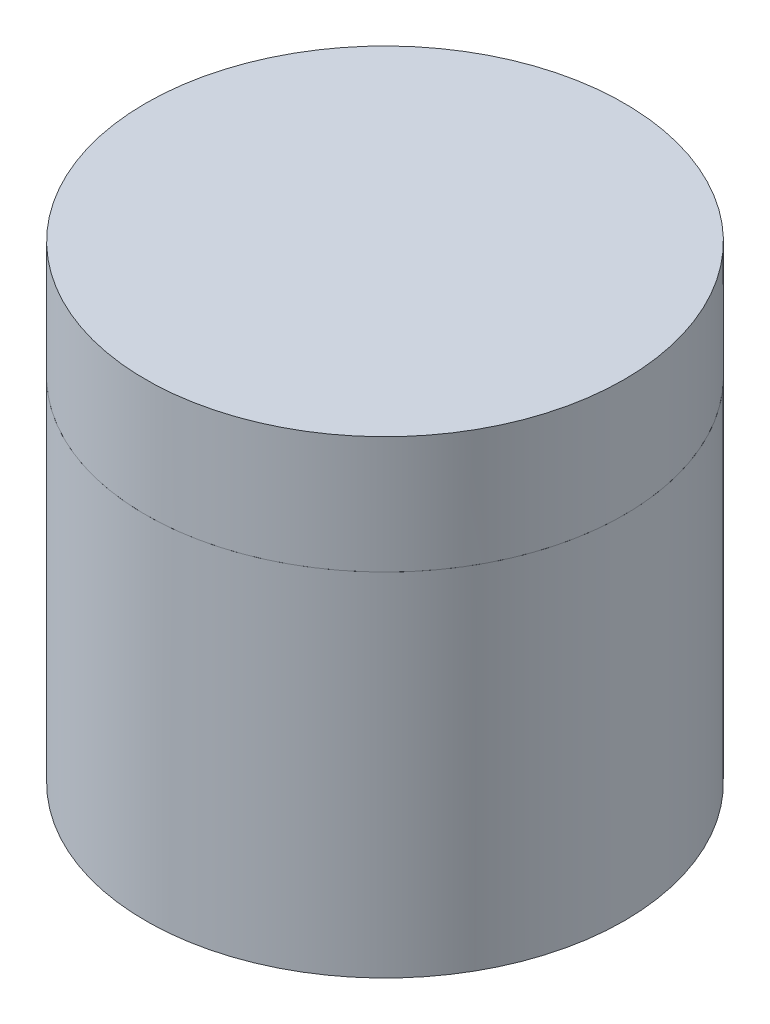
ISO-10303-21;
HEADER;
FILE_DESCRIPTION(('STEP AP214'),'2;1');
FILE_NAME('part.step','',(''),(''),'','','');
FILE_SCHEMA(('AUTOMOTIVE_DESIGN { 1 0 10303 214 1 1 1 1 }'));
ENDSEC;
DATA;
#1=APPLICATION_CONTEXT('core data for automotive mechanical design processes');
#2=APPLICATION_PROTOCOL_DEFINITION('international standard','automotive_design',2000,#1);
#3=PRODUCT_CONTEXT('',#1,'mechanical');
#4=PRODUCT('Part','Part','',(#3));
#5=PRODUCT_RELATED_PRODUCT_CATEGORY('part','',(#4));
#6=PRODUCT_DEFINITION_FORMATION('','',#4);
#7=PRODUCT_DEFINITION_CONTEXT('part definition',#1,'design');
#8=PRODUCT_DEFINITION('design','',#6,#7);
#9=PRODUCT_DEFINITION_SHAPE('','',#8);
#10=(LENGTH_UNIT() NAMED_UNIT(*) SI_UNIT(.MILLI.,.METRE.));
#11=(NAMED_UNIT(*) PLANE_ANGLE_UNIT() SI_UNIT($,.RADIAN.));
#12=(NAMED_UNIT(*) SI_UNIT($,.STERADIAN.) SOLID_ANGLE_UNIT());
#13=UNCERTAINTY_MEASURE_WITH_UNIT(LENGTH_MEASURE(1.E-05),#10,'distance_accuracy_value','');
#14=(GEOMETRIC_REPRESENTATION_CONTEXT(3) GLOBAL_UNCERTAINTY_ASSIGNED_CONTEXT((#13)) GLOBAL_UNIT_ASSIGNED_CONTEXT((#10,
#11,#12)) REPRESENTATION_CONTEXT('',''));
#15=CARTESIAN_POINT('',(0.,0.,0.));
#16=DIRECTION('',(0.,0.,1.));
#17=DIRECTION('',(1.,0.,0.));
#18=AXIS2_PLACEMENT_3D('',#15,#16,#17);
#19=CARTESIAN_POINT('',(0.,11.530484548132,0.));
#20=DIRECTION('',(0.,-1.,0.));
#21=DIRECTION('',(0.,0.,-1.));
#22=AXIS2_PLACEMENT_3D('',#19,#20,#21);
#23=CYLINDRICAL_SURFACE('',#22,31.115);
#24=CARTESIAN_POINT('',(0.,-3.70951545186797,0.));
#25=DIRECTION('',(0.,1.,0.));
#26=DIRECTION('',(-1.,0.,0.));
#27=AXIS2_PLACEMENT_3D('',#24,#25,#26);
#28=CIRCLE('',#27,31.115);
#29=CARTESIAN_POINT('',(-31.115,-3.70951545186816,0.));
#30=VERTEX_POINT('',#29);
#31=EDGE_CURVE('E91',#30,#30,#28,.F.);
#32=ORIENTED_EDGE('',*,*,#31,.F.);
#33=EDGE_LOOP('',(#32));
#34=FACE_BOUND('',#33,.T.);
#35=CARTESIAN_POINT('',(0.,11.530484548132,0.));
#36=DIRECTION('',(0.,-1.,0.));
#37=DIRECTION('',(1.,0.,0.));
#38=AXIS2_PLACEMENT_3D('',#35,#36,#37);
#39=CIRCLE('',#38,31.115);
#40=CARTESIAN_POINT('',(31.115,11.5304845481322,0.));
#41=VERTEX_POINT('',#40);
#42=EDGE_CURVE('E126',#41,#41,#39,.T.);
#43=ORIENTED_EDGE('',*,*,#42,.T.);
#44=EDGE_LOOP('',(#43));
#45=FACE_BOUND('',#44,.T.);
#46=ADVANCED_FACE('F88',(#34,#45),#23,.T.);
#47=CARTESIAN_POINT('',(0.,11.530484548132,0.));
#48=DIRECTION('',(0.,-1.,0.));
#49=DIRECTION('',(1.,0.,0.));
#50=AXIS2_PLACEMENT_3D('',#47,#48,#49);
#51=PLANE('',#50);
#52=ORIENTED_EDGE('',*,*,#42,.F.);
#53=EDGE_LOOP('',(#52));
#54=FACE_BOUND('',#53,.T.);
#55=ADVANCED_FACE('F107',(#54),#51,.F.);
#56=CARTESIAN_POINT('',(0.,-12.7,0.));
#57=DIRECTION('',(0.,1.,0.));
#58=DIRECTION('',(1.,0.,0.));
#59=AXIS2_PLACEMENT_3D('',#56,#57,#58);
#60=SPHERICAL_SURFACE('',#59,20.32);
#61=CARTESIAN_POINT('',(0.,1.1128041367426,0.));
#62=DIRECTION('',(0.,1.,0.));
#63=DIRECTION('',(0.,0.,1.));
#64=AXIS2_PLACEMENT_3D('',#61,#62,#63);
#65=CIRCLE('',#64,14.9033164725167);
#66=CARTESIAN_POINT('',(0.,1.1128041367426,14.9033164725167));
#67=VERTEX_POINT('',#66);
#68=EDGE_CURVE('E127',#67,#67,#65,.T.);
#69=ORIENTED_EDGE('',*,*,#68,.F.);
#70=EDGE_LOOP('',(#69));
#71=FACE_BOUND('',#70,.T.);
#72=ADVANCED_FACE('F116',(#71),#60,.F.);
#73=CARTESIAN_POINT('',(0.,2.6162,0.));
#74=DIRECTION('',(0.,1.,0.));
#75=DIRECTION('',(0.,0.,1.));
#76=AXIS2_PLACEMENT_3D('',#73,#74,#75);
#77=TOROIDAL_SURFACE('',#76,17.6998189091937,3.175);
#78=ORIENTED_EDGE('',*,*,#68,.T.);
#79=EDGE_LOOP('',(#78));
#80=FACE_BOUND('',#79,.T.);
#81=CARTESIAN_POINT('',(0.,-0.546657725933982,0.));
#82=DIRECTION('',(0.,1.,0.));
#83=DIRECTION('',(0.,0.,1.));
#84=AXIS2_PLACEMENT_3D('',#81,#82,#83);
#85=CIRCLE('',#84,17.4224094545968);
#86=CARTESIAN_POINT('',(0.,-0.546657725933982,17.4224094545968));
#87=VERTEX_POINT('',#86);
#88=EDGE_CURVE('E96',#87,#87,#85,.T.);
#89=ORIENTED_EDGE('',*,*,#88,.F.);
#90=EDGE_LOOP('',(#89));
#91=FACE_BOUND('',#90,.T.);
#92=ADVANCED_FACE('F111',(#80,#91),#77,.T.);
#93=CARTESIAN_POINT('',(0.,-3.70951545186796,0.));
#94=DIRECTION('',(0.,1.,0.));
#95=DIRECTION('',(0.,0.,1.));
#96=AXIS2_PLACEMENT_3D('',#93,#94,#95);
#97=TOROIDAL_SURFACE('',#96,17.145,3.175);
#98=CARTESIAN_POINT('',(0.,-3.70951545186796,0.));
#99=DIRECTION('',(0.,1.,0.));
#100=DIRECTION('',(0.,0.,1.));
#101=AXIS2_PLACEMENT_3D('',#98,#99,#100);
#102=CIRCLE('',#101,20.32);
#103=CARTESIAN_POINT('',(0.,-3.70951545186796,-20.32));
#104=VERTEX_POINT('',#103);
#105=EDGE_CURVE('E13',#104,#104,#102,.F.);
#106=ORIENTED_EDGE('',*,*,#105,.T.);
#107=EDGE_LOOP('',(#106));
#108=FACE_BOUND('',#107,.T.);
#109=ORIENTED_EDGE('',*,*,#88,.T.);
#110=EDGE_LOOP('',(#109));
#111=FACE_BOUND('',#110,.T.);
#112=ADVANCED_FACE('F100',(#108,#111),#97,.F.);
#113=CARTESIAN_POINT('',(-0.132956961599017,-3.70951545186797,-20.3200002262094));
#114=DIRECTION('',(0.,1.,0.));
#115=DIRECTION('',(0.999999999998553,0.,1.70137349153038E-06));
#116=AXIS2_PLACEMENT_3D('',#113,#114,#115);
#117=PLANE('',#116);
#118=ORIENTED_EDGE('',*,*,#31,.T.);
#119=EDGE_LOOP('',(#118));
#120=FACE_BOUND('',#119,.T.);
#121=ORIENTED_EDGE('',*,*,#105,.F.);
#122=EDGE_LOOP('',(#121));
#123=FACE_BOUND('',#122,.T.);
#124=ADVANCED_FACE('F103',(#120,#123),#117,.F.);
#125=CLOSED_SHELL('',(#46,#55,#72,#92,#112,#124));
#126=MANIFOLD_SOLID_BREP('B2_NOT_SHOWN',#125);
#127=CARTESIAN_POINT('',(0.,-49.429515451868,0.));
#128=DIRECTION('',(0.,-1.,0.));
#129=DIRECTION('',(1.,0.,0.));
#130=AXIS2_PLACEMENT_3D('',#127,#128,#129);
#131=PLANE('',#130);
#132=CARTESIAN_POINT('',(0.,-49.429515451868,0.));
#133=DIRECTION('',(0.,-1.,0.));
#134=DIRECTION('',(1.,0.,0.));
#135=AXIS2_PLACEMENT_3D('',#132,#133,#134);
#136=CIRCLE('',#135,31.115);
#137=CARTESIAN_POINT('',(31.115,-49.4295154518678,0.));
#138=VERTEX_POINT('',#137);
#139=EDGE_CURVE('E252',#138,#138,#136,.T.);
#140=ORIENTED_EDGE('',*,*,#139,.T.);
#141=EDGE_LOOP('',(#140));
#142=FACE_BOUND('',#141,.T.);
#143=ADVANCED_FACE('F227',(#142),#131,.T.);
#144=CARTESIAN_POINT('',(0.,11.530484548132,0.));
#145=DIRECTION('',(0.,-1.,0.));
#146=DIRECTION('',(0.,0.,-1.));
#147=AXIS2_PLACEMENT_3D('',#144,#145,#146);
#148=CYLINDRICAL_SURFACE('',#147,31.115);
#149=ORIENTED_EDGE('',*,*,#139,.F.);
#150=EDGE_LOOP('',(#149));
#151=FACE_BOUND('',#150,.T.);
#152=CARTESIAN_POINT('',(0.,-3.70951545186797,0.));
#153=DIRECTION('',(0.,1.,0.));
#154=DIRECTION('',(-1.,0.,0.));
#155=AXIS2_PLACEMENT_3D('',#152,#153,#154);
#156=CIRCLE('',#155,31.115);
#157=CARTESIAN_POINT('',(-31.115,-3.70951545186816,0.));
#158=VERTEX_POINT('',#157);
#159=EDGE_CURVE('E86',#158,#158,#156,.F.);
#160=ORIENTED_EDGE('',*,*,#159,.T.);
#161=EDGE_LOOP('',(#160));
#162=FACE_BOUND('',#161,.T.);
#163=ADVANCED_FACE('F229',(#151,#162),#148,.T.);
#164=CARTESIAN_POINT('',(0.,-7.62,0.));
#165=DIRECTION('',(0.,1.,0.));
#166=DIRECTION('',(0.,0.,1.));
#167=AXIS2_PLACEMENT_3D('',#164,#165,#166);
#168=PLANE('',#167);
#169=CARTESIAN_POINT('',(0.,-7.62,0.));
#170=DIRECTION('',(0.,1.,0.));
#171=DIRECTION('',(0.,0.,1.));
#172=AXIS2_PLACEMENT_3D('',#169,#170,#171);
#173=CIRCLE('',#172,3.16856898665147);
#174=CARTESIAN_POINT('',(0.,-7.62,3.16856898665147));
#175=VERTEX_POINT('',#174);
#176=EDGE_CURVE('E250',#175,#175,#173,.T.);
#177=ORIENTED_EDGE('',*,*,#176,.T.);
#178=EDGE_LOOP('',(#177));
#179=FACE_BOUND('',#178,.T.);
#180=ADVANCED_FACE('F285',(#179),#168,.T.);
#181=CARTESIAN_POINT('',(0.,-7.62,0.));
#182=DIRECTION('',(0.,1.,0.));
#183=DIRECTION('',(0.,0.,1.));
#184=AXIS2_PLACEMENT_3D('',#181,#182,#183);
#185=CONICAL_SURFACE('',#184,3.16856898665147,0.174532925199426);
#186=CARTESIAN_POINT('',(0.,-1.19456186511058,0.));
#187=DIRECTION('',(0.,1.,0.));
#188=DIRECTION('',(0.,0.,1.));
#189=AXIS2_PLACEMENT_3D('',#186,#187,#188);
#190=CIRCLE('',#189,4.30154709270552);
#191=CARTESIAN_POINT('',(0.,-1.19456186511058,4.30154709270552));
#192=VERTEX_POINT('',#191);
#193=EDGE_CURVE('E254',#192,#192,#190,.F.);
#194=ORIENTED_EDGE('',*,*,#193,.F.);
#195=EDGE_LOOP('',(#194));
#196=FACE_BOUND('',#195,.T.);
#197=ORIENTED_EDGE('',*,*,#176,.F.);
#198=EDGE_LOOP('',(#197));
#199=FACE_BOUND('',#198,.T.);
#200=ADVANCED_FACE('F290',(#196,#199),#185,.F.);
#201=CARTESIAN_POINT('',(0.,-1.3323951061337,0.));
#202=DIRECTION('',(0.,1.,0.));
#203=DIRECTION('',(0.,0.,1.));
#204=AXIS2_PLACEMENT_3D('',#201,#202,#203);
#205=TOROIDAL_SURFACE('',#204,5.08323824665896,0.79375);
#206=ORIENTED_EDGE('',*,*,#193,.T.);
#207=EDGE_LOOP('',(#206));
#208=FACE_BOUND('',#207,.T.);
#209=CARTESIAN_POINT('',(0.,-0.560541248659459,0.));
#210=DIRECTION('',(0.,-1.,0.));
#211=DIRECTION('',(0.,0.,-1.));
#212=AXIS2_PLACEMENT_3D('',#209,#210,#211);
#213=CIRCLE('',#212,5.26838868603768);
#214=CARTESIAN_POINT('',(0.,-0.560541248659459,-5.26838868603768));
#215=VERTEX_POINT('',#214);
#216=EDGE_CURVE('E247',#215,#215,#213,.F.);
#217=ORIENTED_EDGE('',*,*,#216,.T.);
#218=EDGE_LOOP('',(#217));
#219=FACE_BOUND('',#218,.T.);
#220=ADVANCED_FACE('F265',(#208,#219),#205,.T.);
#221=CARTESIAN_POINT('',(0.,-20.32,0.));
#222=DIRECTION('',(0.,1.,0.));
#223=DIRECTION('',(0.,0.,1.));
#224=AXIS2_PLACEMENT_3D('',#221,#222,#223);
#225=DEGENERATE_TOROIDAL_SURFACE('',#224,0.528537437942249,20.32,.T.);
#226=ORIENTED_EDGE('',*,*,#216,.F.);
#227=EDGE_LOOP('',(#226));
#228=FACE_BOUND('',#227,.T.);
#229=CARTESIAN_POINT('',(0.,-5.95417552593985,0.));
#230=DIRECTION('',(0.,1.,0.));
#231=DIRECTION('',(0.,0.,1.));
#232=AXIS2_PLACEMENT_3D('',#229,#230,#231);
#233=CIRCLE('',#232,14.8995320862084);
#234=CARTESIAN_POINT('',(0.,-5.95417552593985,14.8995320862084));
#235=VERTEX_POINT('',#234);
#236=EDGE_CURVE('E241',#235,#235,#233,.T.);
#237=ORIENTED_EDGE('',*,*,#236,.T.);
#238=EDGE_LOOP('',(#237));
#239=FACE_BOUND('',#238,.T.);
#240=ADVANCED_FACE('F267',(#228,#239),#225,.T.);
#241=CARTESIAN_POINT('',(0.,-3.70951545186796,0.));
#242=DIRECTION('',(0.,1.,0.));
#243=DIRECTION('',(0.,0.,1.));
#244=AXIS2_PLACEMENT_3D('',#241,#242,#243);
#245=TOROIDAL_SURFACE('',#244,17.145,3.175);
#246=ORIENTED_EDGE('',*,*,#236,.F.);
#247=EDGE_LOOP('',(#246));
#248=FACE_BOUND('',#247,.T.);
#249=CARTESIAN_POINT('',(0.,-3.70951545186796,0.));
#250=DIRECTION('',(0.,1.,0.));
#251=DIRECTION('',(0.,0.,1.));
#252=AXIS2_PLACEMENT_3D('',#249,#250,#251);
#253=CIRCLE('',#252,20.32);
#254=CARTESIAN_POINT('',(0.,-3.70951545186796,-20.32));
#255=VERTEX_POINT('',#254);
#256=EDGE_CURVE('E234',#255,#255,#253,.F.);
#257=ORIENTED_EDGE('',*,*,#256,.F.);
#258=EDGE_LOOP('',(#257));
#259=FACE_BOUND('',#258,.T.);
#260=ADVANCED_FACE('F238',(#248,#259),#245,.F.);
#261=CARTESIAN_POINT('',(-0.132956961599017,-3.70951545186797,-20.3200002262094));
#262=DIRECTION('',(0.,1.,0.));
#263=DIRECTION('',(0.999999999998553,0.,1.70137349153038E-06));
#264=AXIS2_PLACEMENT_3D('',#261,#262,#263);
#265=PLANE('',#264);
#266=ORIENTED_EDGE('',*,*,#159,.F.);
#267=EDGE_LOOP('',(#266));
#268=FACE_BOUND('',#267,.T.);
#269=ORIENTED_EDGE('',*,*,#256,.T.);
#270=EDGE_LOOP('',(#269));
#271=FACE_BOUND('',#270,.T.);
#272=ADVANCED_FACE('F274',(#268,#271),#265,.T.);
#273=CLOSED_SHELL('',(#143,#163,#180,#200,#220,#240,#260,#272));
#274=MANIFOLD_SOLID_BREP('B7',#273);
#275=CARTESIAN_POINT('',(0.,-3.70951545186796,0.));
#276=DIRECTION('',(0.,1.,0.));
#277=DIRECTION('',(0.,0.,1.));
#278=AXIS2_PLACEMENT_3D('',#275,#276,#277);
#279=TOROIDAL_SURFACE('',#278,17.145,3.175);
#280=CARTESIAN_POINT('',(0.,-5.95417552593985,0.));
#281=DIRECTION('',(0.,1.,0.));
#282=DIRECTION('',(0.,0.,1.));
#283=AXIS2_PLACEMENT_3D('',#280,#281,#282);
#284=CIRCLE('',#283,14.8995320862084);
#285=CARTESIAN_POINT('',(0.,-5.95417552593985,14.8995320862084));
#286=VERTEX_POINT('',#285);
#287=EDGE_CURVE('E674',#286,#286,#284,.T.);
#288=ORIENTED_EDGE('',*,*,#287,.T.);
#289=EDGE_LOOP('',(#288));
#290=FACE_BOUND('',#289,.T.);
#291=CARTESIAN_POINT('',(0.,-3.70951545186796,0.));
#292=DIRECTION('',(0.,-1.,0.));
#293=DIRECTION('',(0.,0.,-1.));
#294=AXIS2_PLACEMENT_3D('',#291,#292,#293);
#295=CIRCLE('',#294,20.32);
#296=CARTESIAN_POINT('',(0.,-3.70951545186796,-20.32));
#297=VERTEX_POINT('',#296);
#298=EDGE_CURVE('E534',#297,#297,#295,.T.);
#299=ORIENTED_EDGE('',*,*,#298,.T.);
#300=EDGE_LOOP('',(#299));
#301=FACE_BOUND('',#300,.T.);
#302=ADVANCED_FACE('F645',(#290,#301),#279,.T.);
#303=ORIENTED_EDGE('',*,*,#298,.F.);
#304=EDGE_LOOP('',(#303));
#305=FACE_BOUND('',#304,.T.);
#306=CARTESIAN_POINT('',(0.,-0.546657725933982,0.));
#307=DIRECTION('',(0.,1.,0.));
#308=DIRECTION('',(0.,0.,1.));
#309=AXIS2_PLACEMENT_3D('',#306,#307,#308);
#310=CIRCLE('',#309,17.4224094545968);
#311=CARTESIAN_POINT('',(0.,-0.546657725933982,17.4224094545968));
#312=VERTEX_POINT('',#311);
#313=EDGE_CURVE('E663',#312,#312,#310,.T.);
#314=ORIENTED_EDGE('',*,*,#313,.F.);
#315=EDGE_LOOP('',(#314));
#316=FACE_BOUND('',#315,.T.);
#317=ADVANCED_FACE('F692',(#305,#316),#279,.T.);
#318=CARTESIAN_POINT('',(0.,2.6162,0.));
#319=DIRECTION('',(0.,1.,0.));
#320=DIRECTION('',(0.,0.,1.));
#321=AXIS2_PLACEMENT_3D('',#318,#319,#320);
#322=TOROIDAL_SURFACE('',#321,17.6998189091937,3.175);
#323=CARTESIAN_POINT('',(0.,1.1128041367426,0.));
#324=DIRECTION('',(0.,1.,0.));
#325=DIRECTION('',(0.,0.,1.));
#326=AXIS2_PLACEMENT_3D('',#323,#324,#325);
#327=CIRCLE('',#326,14.9033164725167);
#328=CARTESIAN_POINT('',(0.,1.1128041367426,14.9033164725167));
#329=VERTEX_POINT('',#328);
#330=EDGE_CURVE('E668',#329,#329,#327,.T.);
#331=ORIENTED_EDGE('',*,*,#330,.F.);
#332=EDGE_LOOP('',(#331));
#333=FACE_BOUND('',#332,.T.);
#334=ORIENTED_EDGE('',*,*,#313,.T.);
#335=EDGE_LOOP('',(#334));
#336=FACE_BOUND('',#335,.T.);
#337=ADVANCED_FACE('F696',(#333,#336),#322,.F.);
#338=CARTESIAN_POINT('',(0.,-12.7,0.));
#339=DIRECTION('',(0.,1.,0.));
#340=DIRECTION('',(1.,0.,0.));
#341=AXIS2_PLACEMENT_3D('',#338,#339,#340);
#342=SPHERICAL_SURFACE('',#341,20.32);
#343=ORIENTED_EDGE('',*,*,#330,.T.);
#344=EDGE_LOOP('',(#343));
#345=FACE_BOUND('',#344,.T.);
#346=ADVANCED_FACE('F701',(#345),#342,.T.);
#347=CARTESIAN_POINT('',(0.,-7.62,0.));
#348=DIRECTION('',(0.,1.,0.));
#349=DIRECTION('',(0.,0.,1.));
#350=AXIS2_PLACEMENT_3D('',#347,#348,#349);
#351=PLANE('',#350);
#352=CARTESIAN_POINT('',(0.,-7.62,0.));
#353=DIRECTION('',(0.,1.,0.));
#354=DIRECTION('',(0.,0.,1.));
#355=AXIS2_PLACEMENT_3D('',#352,#353,#354);
#356=CIRCLE('',#355,3.16856898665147);
#357=CARTESIAN_POINT('',(0.,-7.62,3.16856898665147));
#358=VERTEX_POINT('',#357);
#359=EDGE_CURVE('E671',#358,#358,#356,.T.);
#360=ORIENTED_EDGE('',*,*,#359,.F.);
#361=EDGE_LOOP('',(#360));
#362=FACE_BOUND('',#361,.T.);
#363=ADVANCED_FACE('F689',(#362),#351,.F.);
#364=CARTESIAN_POINT('',(0.,-7.62,0.));
#365=DIRECTION('',(0.,1.,0.));
#366=DIRECTION('',(0.,0.,1.));
#367=AXIS2_PLACEMENT_3D('',#364,#365,#366);
#368=CONICAL_SURFACE('',#367,3.16856898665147,0.174532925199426);
#369=CARTESIAN_POINT('',(0.,-1.19456186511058,0.));
#370=DIRECTION('',(0.,1.,0.));
#371=DIRECTION('',(0.,0.,1.));
#372=AXIS2_PLACEMENT_3D('',#369,#370,#371);
#373=CIRCLE('',#372,4.30154709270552);
#374=CARTESIAN_POINT('',(0.,-1.19456186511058,4.30154709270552));
#375=VERTEX_POINT('',#374);
#376=EDGE_CURVE('E653',#375,#375,#373,.F.);
#377=ORIENTED_EDGE('',*,*,#376,.T.);
#378=EDGE_LOOP('',(#377));
#379=FACE_BOUND('',#378,.T.);
#380=ORIENTED_EDGE('',*,*,#359,.T.);
#381=EDGE_LOOP('',(#380));
#382=FACE_BOUND('',#381,.T.);
#383=ADVANCED_FACE('F681',(#379,#382),#368,.T.);
#384=CARTESIAN_POINT('',(0.,-20.32,0.));
#385=DIRECTION('',(0.,1.,0.));
#386=DIRECTION('',(0.,0.,1.));
#387=AXIS2_PLACEMENT_3D('',#384,#385,#386);
#388=DEGENERATE_TOROIDAL_SURFACE('',#387,0.528537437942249,20.32,.T.);
#389=CARTESIAN_POINT('',(0.,-0.560541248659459,0.));
#390=DIRECTION('',(0.,-1.,0.));
#391=DIRECTION('',(0.,0.,-1.));
#392=AXIS2_PLACEMENT_3D('',#389,#390,#391);
#393=CIRCLE('',#392,5.26838868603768);
#394=CARTESIAN_POINT('',(0.,-0.560541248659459,-5.26838868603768));
#395=VERTEX_POINT('',#394);
#396=EDGE_CURVE('E659',#395,#395,#393,.F.);
#397=ORIENTED_EDGE('',*,*,#396,.T.);
#398=EDGE_LOOP('',(#397));
#399=FACE_BOUND('',#398,.T.);
#400=ORIENTED_EDGE('',*,*,#287,.F.);
#401=EDGE_LOOP('',(#400));
#402=FACE_BOUND('',#401,.T.);
#403=ADVANCED_FACE('F679',(#399,#402),#388,.F.);
#404=CARTESIAN_POINT('',(0.,-1.3323951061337,0.));
#405=DIRECTION('',(0.,1.,0.));
#406=DIRECTION('',(0.,0.,1.));
#407=AXIS2_PLACEMENT_3D('',#404,#405,#406);
#408=TOROIDAL_SURFACE('',#407,5.08323824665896,0.79375);
#409=ORIENTED_EDGE('',*,*,#376,.F.);
#410=EDGE_LOOP('',(#409));
#411=FACE_BOUND('',#410,.T.);
#412=ORIENTED_EDGE('',*,*,#396,.F.);
#413=EDGE_LOOP('',(#412));
#414=FACE_BOUND('',#413,.T.);
#415=ADVANCED_FACE('F647',(#411,#414),#408,.F.);
#416=CLOSED_SHELL('',(#302,#317,#337,#346,#363,#383,#403,#415));
#417=MANIFOLD_SOLID_BREP('B450_NOT_SHOWN',#416);
#418=ADVANCED_BREP_SHAPE_REPRESENTATION('',(#18,#126,#274,#417),#14);
#419=SHAPE_DEFINITION_REPRESENTATION(#9,#418);
ENDSEC;
END-ISO-10303-21;
